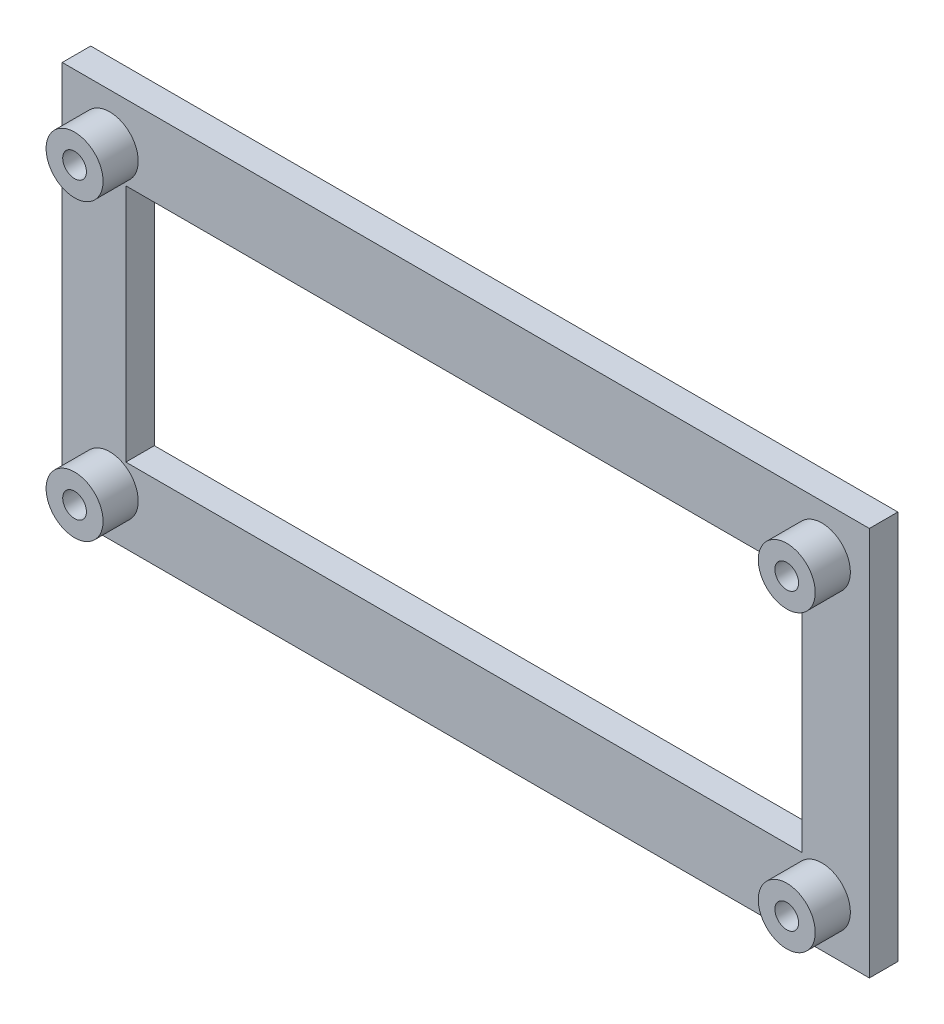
from build123d import *

# Parameters (mm, degrees)
SKIZZE1_W                       = 85
SKIZZE1_H                       = 41
SKIZZE1_R                       = 3
SKIZZE1_W_2                     = 71.2
SKIZZE1_H_2                     = 25.2
SKIZZE1_R_2                     = 1.25
AUFSATZ_LINEAR_AUSTRAGEN1_DEPTH = 3
SKIZZE2_R                       = 3
SKIZZE2_R_2                     = 1.25
AUFSATZ_LINEAR_AUSTRAGEN2_DEPTH = 3.7


with BuildPart() as part:
    # Skizze1 → Aufsatz-Linear austragen1 (new body)
    # profile 1 of 9: a face of its own
    with BuildSketch(Plane.XY):
        Rectangle(SKIZZE1_W, SKIZZE1_H)
        with Locations((-37.5, -15.5)):
            Circle(SKIZZE1_R, mode=Mode.SUBTRACT)
        with Locations((37.5, -15.5)):
            Circle(SKIZZE1_R, mode=Mode.SUBTRACT)
        with Locations((37.5, 15.5)):
            Circle(SKIZZE1_R, mode=Mode.SUBTRACT)
        with Locations((-37.5, 15.5)):
            Circle(SKIZZE1_R, mode=Mode.SUBTRACT)
        with Locations((-0.2, 0)):
            Rectangle(SKIZZE1_W_2, SKIZZE1_H_2, mode=Mode.SUBTRACT)
    # profile 2 of 9: a face of its own
    with BuildSketch(Plane.XY):
        with Locations((-37.5, 15.5)):
            Circle(SKIZZE1_R)
        with Locations((-37.5, 15.5)):
            Circle(SKIZZE1_R_2, mode=Mode.SUBTRACT)
    # profile 3 of 9: a face of its own
    with BuildSketch(Plane.XY):
        with Locations((-37.5, 15.5)):
            Circle(SKIZZE1_R_2)
    # profile 4 of 9: a face of its own
    with BuildSketch(Plane.XY):
        with Locations((37.5, 15.5)):
            Circle(SKIZZE1_R)
        with Locations((37.5, 15.5)):
            Circle(SKIZZE1_R_2, mode=Mode.SUBTRACT)
    # profile 5 of 9: a face of its own
    with BuildSketch(Plane.XY):
        with Locations((37.5, 15.5)):
            Circle(SKIZZE1_R_2)
    # profile 6 of 9: a face of its own
    with BuildSketch(Plane.XY):
        with Locations((37.5, -15.5)):
            Circle(SKIZZE1_R)
        with Locations((37.5, -15.5)):
            Circle(SKIZZE1_R_2, mode=Mode.SUBTRACT)
    # profile 7 of 9: a face of its own
    with BuildSketch(Plane.XY):
        with Locations((37.5, -15.5)):
            Circle(SKIZZE1_R_2)
    # profile 8 of 9: a face of its own
    with BuildSketch(Plane.XY):
        with Locations((-37.5, -15.5)):
            Circle(SKIZZE1_R)
        with Locations((-37.5, -15.5)):
            Circle(SKIZZE1_R_2, mode=Mode.SUBTRACT)
    # profile 9 of 9: a face of its own
    with BuildSketch(Plane.XY):
        with Locations((-37.5, -15.5)):
            Circle(SKIZZE1_R_2)
    extrude(amount=AUFSATZ_LINEAR_AUSTRAGEN1_DEPTH)

    # Skizze2 → Aufsatz-Linear austragen2 (add)
    # profile 1 of 4: a face of its own
    with BuildSketch(Plane.XY.offset(3)):
        with Locations((-37.5, 15.5)):
            Circle(SKIZZE2_R)
        with Locations((-37.5, 15.5)):
            Circle(SKIZZE2_R_2, mode=Mode.SUBTRACT)
    # profile 2 of 4: a face of its own
    with BuildSketch(Plane.XY.offset(3)):
        with Locations((37.5, 15.5)):
            Circle(SKIZZE2_R)
        with Locations((37.5, 15.5)):
            Circle(SKIZZE2_R_2, mode=Mode.SUBTRACT)
    # profile 3 of 4: a face of its own
    with BuildSketch(Plane.XY.offset(3)):
        with Locations((37.5, -15.5)):
            Circle(SKIZZE2_R)
        with Locations((37.5, -15.5)):
            Circle(SKIZZE2_R_2, mode=Mode.SUBTRACT)
    # profile 4 of 4: a face of its own
    with BuildSketch(Plane.XY.offset(3)):
        with Locations((-37.5, -15.5)):
            Circle(SKIZZE2_R)
        with Locations((-37.5, -15.5)):
            Circle(SKIZZE2_R_2, mode=Mode.SUBTRACT)
    extrude(amount=AUFSATZ_LINEAR_AUSTRAGEN2_DEPTH)


solid = part.part
